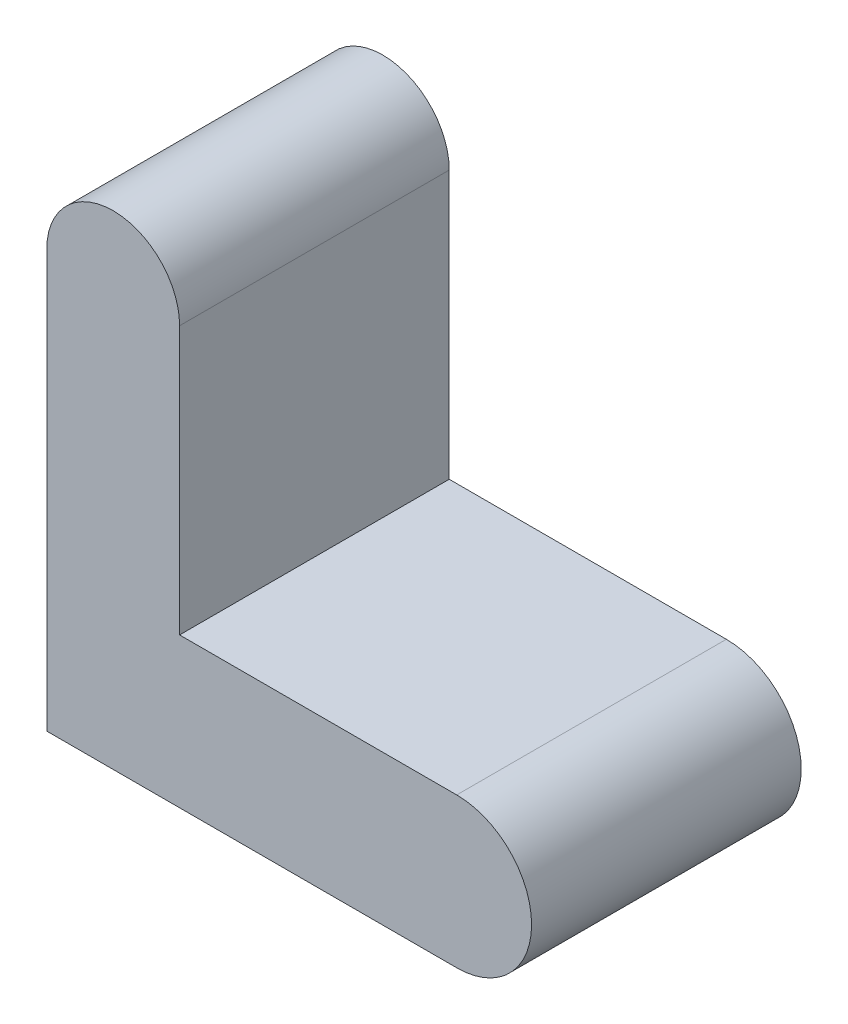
ISO-10303-21;
HEADER;
FILE_DESCRIPTION(('STEP AP214'),'2;1');
FILE_NAME('part.step','',(''),(''),'','','');
FILE_SCHEMA(('AUTOMOTIVE_DESIGN { 1 0 10303 214 1 1 1 1 }'));
ENDSEC;
DATA;
#1=APPLICATION_CONTEXT('core data for automotive mechanical design processes');
#2=APPLICATION_PROTOCOL_DEFINITION('international standard','automotive_design',2000,#1);
#3=PRODUCT_CONTEXT('',#1,'mechanical');
#4=PRODUCT('Part','Part','',(#3));
#5=PRODUCT_RELATED_PRODUCT_CATEGORY('part','',(#4));
#6=PRODUCT_DEFINITION_FORMATION('','',#4);
#7=PRODUCT_DEFINITION_CONTEXT('part definition',#1,'design');
#8=PRODUCT_DEFINITION('design','',#6,#7);
#9=PRODUCT_DEFINITION_SHAPE('','',#8);
#10=(LENGTH_UNIT() NAMED_UNIT(*) SI_UNIT(.MILLI.,.METRE.));
#11=(NAMED_UNIT(*) PLANE_ANGLE_UNIT() SI_UNIT($,.RADIAN.));
#12=(NAMED_UNIT(*) SI_UNIT($,.STERADIAN.) SOLID_ANGLE_UNIT());
#13=UNCERTAINTY_MEASURE_WITH_UNIT(LENGTH_MEASURE(1.E-05),#10,'distance_accuracy_value','');
#14=(GEOMETRIC_REPRESENTATION_CONTEXT(3) GLOBAL_UNCERTAINTY_ASSIGNED_CONTEXT((#13)) GLOBAL_UNIT_ASSIGNED_CONTEXT((#10,
#11,#12)) REPRESENTATION_CONTEXT('',''));
#15=CARTESIAN_POINT('',(0.,0.,0.));
#16=DIRECTION('',(0.,0.,1.));
#17=DIRECTION('',(1.,0.,0.));
#18=AXIS2_PLACEMENT_3D('',#15,#16,#17);
#19=CARTESIAN_POINT('',(45.1262891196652,0.,100.));
#20=DIRECTION('',(0.,0.,-1.));
#21=DIRECTION('',(-1.,0.,0.));
#22=AXIS2_PLACEMENT_3D('',#19,#20,#21);
#23=CYLINDRICAL_SURFACE('',#22,19.4348844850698);
#24=CARTESIAN_POINT('',(45.1262891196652,0.,30.));
#25=DIRECTION('',(0.,0.,1.));
#26=DIRECTION('',(1.,0.,0.));
#27=AXIS2_PLACEMENT_3D('',#24,#25,#26);
#28=CIRCLE('',#27,19.4348844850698);
#29=CARTESIAN_POINT('',(45.1262891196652,-19.4348844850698,30.));
#30=VERTEX_POINT('',#29);
#31=CARTESIAN_POINT('',(45.1262891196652,19.4348844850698,30.));
#32=VERTEX_POINT('',#31);
#33=EDGE_CURVE('E117',#30,#32,#28,.T.);
#34=ORIENTED_EDGE('',*,*,#33,.T.);
#35=DIRECTION('',(0.,0.,-1.));
#36=VECTOR('',#35,1.);
#37=CARTESIAN_POINT('',(45.1262891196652,19.4348844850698,100.));
#38=LINE('',#37,#36);
#39=CARTESIAN_POINT('',(45.1262891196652,19.4348844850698,100.));
#40=VERTEX_POINT('',#39);
#41=EDGE_CURVE('E11',#40,#32,#38,.T.);
#42=ORIENTED_EDGE('',*,*,#41,.F.);
#43=CARTESIAN_POINT('',(45.1262891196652,0.,100.));
#44=DIRECTION('',(0.,0.,1.));
#45=DIRECTION('',(1.,0.,0.));
#46=AXIS2_PLACEMENT_3D('',#43,#44,#45);
#47=CIRCLE('',#46,19.4348844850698);
#48=CARTESIAN_POINT('',(45.1262891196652,-19.4348844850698,100.));
#49=VERTEX_POINT('',#48);
#50=EDGE_CURVE('E127',#49,#40,#47,.T.);
#51=ORIENTED_EDGE('',*,*,#50,.F.);
#52=DIRECTION('',(0.,0.,-1.));
#53=VECTOR('',#52,1.);
#54=CARTESIAN_POINT('',(45.1262891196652,-19.4348844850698,100.));
#55=LINE('',#54,#53);
#56=EDGE_CURVE('E113',#49,#30,#55,.T.);
#57=ORIENTED_EDGE('',*,*,#56,.T.);
#58=EDGE_LOOP('',(#34,#42,#51,#57));
#59=FACE_BOUND('',#58,.T.);
#60=ADVANCED_FACE('F33',(#59),#23,.T.);
#61=CARTESIAN_POINT('',(45.1262891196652,19.4348844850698,100.));
#62=DIRECTION('',(0.,-1.,0.));
#63=DIRECTION('',(1.,0.,0.));
#64=AXIS2_PLACEMENT_3D('',#61,#62,#63);
#65=PLANE('',#64);
#66=DIRECTION('',(-1.,0.,0.));
#67=VECTOR('',#66,1.);
#68=CARTESIAN_POINT('',(45.1262891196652,19.4348844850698,30.));
#69=LINE('',#68,#67);
#70=CARTESIAN_POINT('',(-26.8203416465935,19.4348844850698,30.));
#71=VERTEX_POINT('',#70);
#72=EDGE_CURVE('E120',#32,#71,#69,.T.);
#73=ORIENTED_EDGE('',*,*,#72,.T.);
#74=DIRECTION('',(0.,0.,-1.));
#75=VECTOR('',#74,1.);
#76=CARTESIAN_POINT('',(-26.8203416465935,19.4348844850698,100.));
#77=LINE('',#76,#75);
#78=CARTESIAN_POINT('',(-26.8203416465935,19.4348844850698,100.));
#79=VERTEX_POINT('',#78);
#80=EDGE_CURVE('E41',#79,#71,#77,.T.);
#81=ORIENTED_EDGE('',*,*,#80,.F.);
#82=DIRECTION('',(-1.,0.,0.));
#83=VECTOR('',#82,1.);
#84=CARTESIAN_POINT('',(45.1262891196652,19.4348844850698,100.));
#85=LINE('',#84,#83);
#86=EDGE_CURVE('E86',#40,#79,#85,.T.);
#87=ORIENTED_EDGE('',*,*,#86,.F.);
#88=ORIENTED_EDGE('',*,*,#41,.T.);
#89=EDGE_LOOP('',(#73,#81,#87,#88));
#90=FACE_BOUND('',#89,.T.);
#91=ADVANCED_FACE('F151',(#90),#65,.F.);
#92=CARTESIAN_POINT('',(-26.8203416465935,19.4348844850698,100.));
#93=DIRECTION('',(-1.,0.,0.));
#94=DIRECTION('',(0.,0.,1.));
#95=AXIS2_PLACEMENT_3D('',#92,#93,#94);
#96=PLANE('',#95);
#97=DIRECTION('',(0.,1.,0.));
#98=VECTOR('',#97,1.);
#99=CARTESIAN_POINT('',(-26.8203416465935,19.4348844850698,30.));
#100=LINE('',#99,#98);
#101=CARTESIAN_POINT('',(-26.8203416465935,88.9543759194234,30.));
#102=VERTEX_POINT('',#101);
#103=EDGE_CURVE('E122',#71,#102,#100,.T.);
#104=ORIENTED_EDGE('',*,*,#103,.T.);
#105=DIRECTION('',(0.,0.,-1.));
#106=VECTOR('',#105,1.);
#107=CARTESIAN_POINT('',(-26.8203416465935,88.9543759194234,100.));
#108=LINE('',#107,#106);
#109=CARTESIAN_POINT('',(-26.8203416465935,88.9543759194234,100.));
#110=VERTEX_POINT('',#109);
#111=EDGE_CURVE('E108',#110,#102,#108,.T.);
#112=ORIENTED_EDGE('',*,*,#111,.F.);
#113=DIRECTION('',(0.,1.,0.));
#114=VECTOR('',#113,1.);
#115=CARTESIAN_POINT('',(-26.8203416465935,19.4348844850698,100.));
#116=LINE('',#115,#114);
#117=EDGE_CURVE('E99',#79,#110,#116,.T.);
#118=ORIENTED_EDGE('',*,*,#117,.F.);
#119=ORIENTED_EDGE('',*,*,#80,.T.);
#120=EDGE_LOOP('',(#104,#112,#118,#119));
#121=FACE_BOUND('',#120,.T.);
#122=ADVANCED_FACE('F133',(#121),#96,.F.);
#123=CARTESIAN_POINT('',(-44.061989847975,88.9543759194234,100.));
#124=DIRECTION('',(0.,0.,-1.));
#125=DIRECTION('',(-1.,0.,0.));
#126=AXIS2_PLACEMENT_3D('',#123,#124,#125);
#127=CYLINDRICAL_SURFACE('',#126,17.2416482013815);
#128=CARTESIAN_POINT('',(-44.061989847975,88.9543759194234,30.));
#129=DIRECTION('',(0.,0.,1.));
#130=DIRECTION('',(1.,0.,0.));
#131=AXIS2_PLACEMENT_3D('',#128,#129,#130);
#132=CIRCLE('',#131,17.2416482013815);
#133=CARTESIAN_POINT('',(-61.3036380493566,88.9543759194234,30.));
#134=VERTEX_POINT('',#133);
#135=EDGE_CURVE('E107',#102,#134,#132,.T.);
#136=ORIENTED_EDGE('',*,*,#135,.T.);
#137=DIRECTION('',(0.,0.,-1.));
#138=VECTOR('',#137,1.);
#139=CARTESIAN_POINT('',(-61.3036380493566,88.9543759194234,100.));
#140=LINE('',#139,#138);
#141=CARTESIAN_POINT('',(-61.3036380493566,88.9543759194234,100.));
#142=VERTEX_POINT('',#141);
#143=EDGE_CURVE('E104',#142,#134,#140,.T.);
#144=ORIENTED_EDGE('',*,*,#143,.F.);
#145=CARTESIAN_POINT('',(-44.061989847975,88.9543759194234,100.));
#146=DIRECTION('',(0.,0.,1.));
#147=DIRECTION('',(1.,0.,0.));
#148=AXIS2_PLACEMENT_3D('',#145,#146,#147);
#149=CIRCLE('',#148,17.2416482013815);
#150=EDGE_CURVE('E93',#110,#142,#149,.T.);
#151=ORIENTED_EDGE('',*,*,#150,.F.);
#152=ORIENTED_EDGE('',*,*,#111,.T.);
#153=EDGE_LOOP('',(#136,#144,#151,#152));
#154=FACE_BOUND('',#153,.T.);
#155=ADVANCED_FACE('F105',(#154),#127,.T.);
#156=CARTESIAN_POINT('',(-61.3036380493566,88.9543759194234,100.));
#157=DIRECTION('',(1.,0.,0.));
#158=DIRECTION('',(0.,1.,0.));
#159=AXIS2_PLACEMENT_3D('',#156,#157,#158);
#160=PLANE('',#159);
#161=DIRECTION('',(0.,-1.,0.));
#162=VECTOR('',#161,1.);
#163=CARTESIAN_POINT('',(-61.3036380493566,88.9543759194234,30.));
#164=LINE('',#163,#162);
#165=CARTESIAN_POINT('',(-61.3036380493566,-19.4348844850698,30.));
#166=VERTEX_POINT('',#165);
#167=EDGE_CURVE('E72',#134,#166,#164,.T.);
#168=ORIENTED_EDGE('',*,*,#167,.T.);
#169=DIRECTION('',(0.,0.,-1.));
#170=VECTOR('',#169,1.);
#171=CARTESIAN_POINT('',(-61.3036380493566,-19.4348844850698,100.));
#172=LINE('',#171,#170);
#173=CARTESIAN_POINT('',(-61.3036380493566,-19.4348844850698,100.));
#174=VERTEX_POINT('',#173);
#175=EDGE_CURVE('E109',#174,#166,#172,.T.);
#176=ORIENTED_EDGE('',*,*,#175,.F.);
#177=DIRECTION('',(0.,-1.,0.));
#178=VECTOR('',#177,1.);
#179=CARTESIAN_POINT('',(-61.3036380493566,88.9543759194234,100.));
#180=LINE('',#179,#178);
#181=EDGE_CURVE('E97',#142,#174,#180,.T.);
#182=ORIENTED_EDGE('',*,*,#181,.F.);
#183=ORIENTED_EDGE('',*,*,#143,.T.);
#184=EDGE_LOOP('',(#168,#176,#182,#183));
#185=FACE_BOUND('',#184,.T.);
#186=ADVANCED_FACE('F111',(#185),#160,.F.);
#187=CARTESIAN_POINT('',(-61.3036380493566,-19.4348844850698,100.));
#188=DIRECTION('',(0.,1.,0.));
#189=DIRECTION('',(-1.,0.,0.));
#190=AXIS2_PLACEMENT_3D('',#187,#188,#189);
#191=PLANE('',#190);
#192=DIRECTION('',(1.,0.,0.));
#193=VECTOR('',#192,1.);
#194=CARTESIAN_POINT('',(-61.3036380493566,-19.4348844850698,30.));
#195=LINE('',#194,#193);
#196=EDGE_CURVE('E78',#166,#30,#195,.T.);
#197=ORIENTED_EDGE('',*,*,#196,.T.);
#198=ORIENTED_EDGE('',*,*,#56,.F.);
#199=DIRECTION('',(1.,0.,0.));
#200=VECTOR('',#199,1.);
#201=CARTESIAN_POINT('',(-61.3036380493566,-19.4348844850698,100.));
#202=LINE('',#201,#200);
#203=EDGE_CURVE('E49',#174,#49,#202,.T.);
#204=ORIENTED_EDGE('',*,*,#203,.F.);
#205=ORIENTED_EDGE('',*,*,#175,.T.);
#206=EDGE_LOOP('',(#197,#198,#204,#205));
#207=FACE_BOUND('',#206,.T.);
#208=ADVANCED_FACE('F140',(#207),#191,.F.);
#209=CARTESIAN_POINT('',(45.1262891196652,0.,100.));
#210=DIRECTION('',(0.,0.,1.));
#211=DIRECTION('',(1.,0.,0.));
#212=AXIS2_PLACEMENT_3D('',#209,#210,#211);
#213=PLANE('',#212);
#214=ORIENTED_EDGE('',*,*,#50,.T.);
#215=ORIENTED_EDGE('',*,*,#86,.T.);
#216=ORIENTED_EDGE('',*,*,#117,.T.);
#217=ORIENTED_EDGE('',*,*,#150,.T.);
#218=ORIENTED_EDGE('',*,*,#181,.T.);
#219=ORIENTED_EDGE('',*,*,#203,.T.);
#220=EDGE_LOOP('',(#214,#215,#216,#217,#218,#219));
#221=FACE_BOUND('',#220,.T.);
#222=ADVANCED_FACE('F95',(#221),#213,.T.);
#223=CARTESIAN_POINT('',(45.1262891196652,0.,30.));
#224=DIRECTION('',(0.,0.,1.));
#225=DIRECTION('',(1.,0.,0.));
#226=AXIS2_PLACEMENT_3D('',#223,#224,#225);
#227=PLANE('',#226);
#228=ORIENTED_EDGE('',*,*,#33,.F.);
#229=ORIENTED_EDGE('',*,*,#196,.F.);
#230=ORIENTED_EDGE('',*,*,#167,.F.);
#231=ORIENTED_EDGE('',*,*,#135,.F.);
#232=ORIENTED_EDGE('',*,*,#103,.F.);
#233=ORIENTED_EDGE('',*,*,#72,.F.);
#234=EDGE_LOOP('',(#228,#229,#230,#231,#232,#233));
#235=FACE_BOUND('',#234,.T.);
#236=ADVANCED_FACE('F136',(#235),#227,.F.);
#237=CLOSED_SHELL('',(#60,#91,#122,#155,#186,#208,#222,#236));
#238=MANIFOLD_SOLID_BREP('B2',#237);
#239=ADVANCED_BREP_SHAPE_REPRESENTATION('',(#18,#238),#14);
#240=SHAPE_DEFINITION_REPRESENTATION(#9,#239);
ENDSEC;
END-ISO-10303-21;
